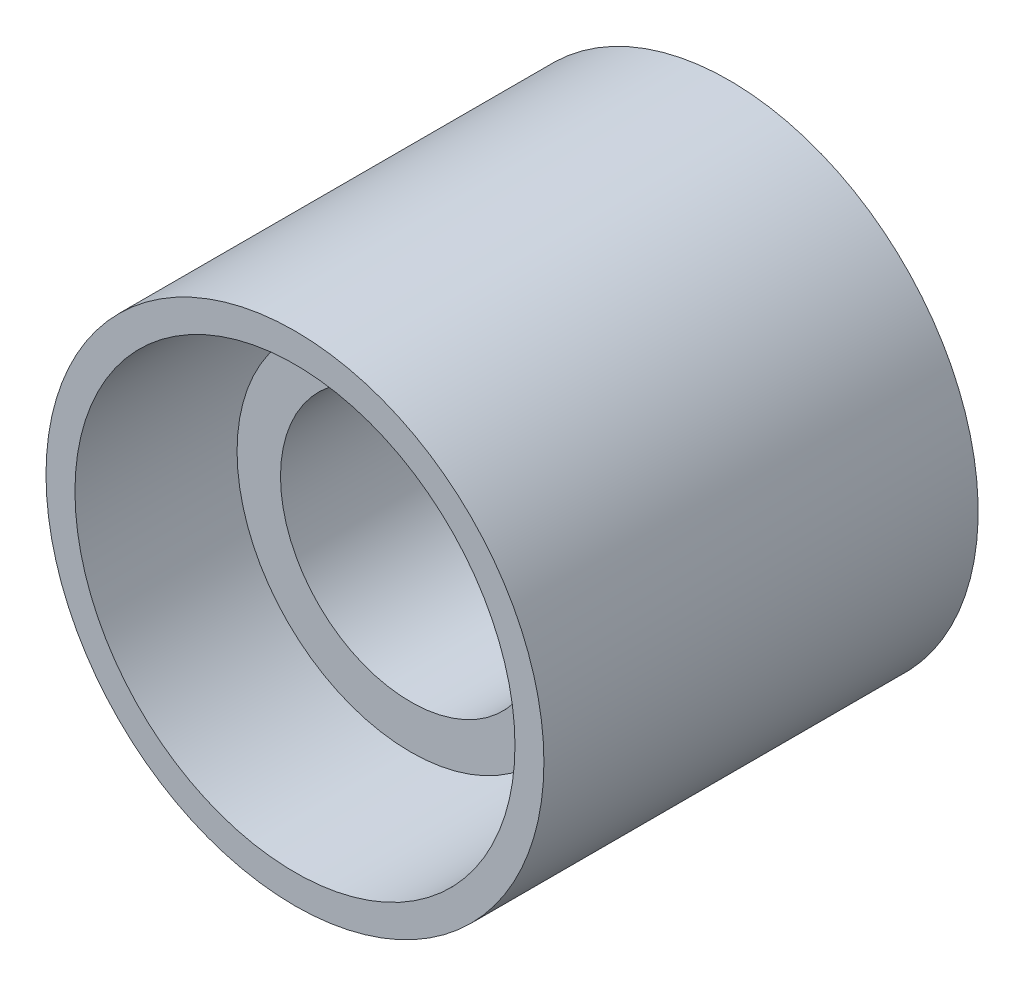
ISO-10303-21;
HEADER;
FILE_DESCRIPTION(('STEP AP214'),'2;1');
FILE_NAME('part.step','',(''),(''),'','','');
FILE_SCHEMA(('AUTOMOTIVE_DESIGN { 1 0 10303 214 1 1 1 1 }'));
ENDSEC;
DATA;
#1=APPLICATION_CONTEXT('core data for automotive mechanical design processes');
#2=APPLICATION_PROTOCOL_DEFINITION('international standard','automotive_design',2000,#1);
#3=PRODUCT_CONTEXT('',#1,'mechanical');
#4=PRODUCT('Part','Part','',(#3));
#5=PRODUCT_RELATED_PRODUCT_CATEGORY('part','',(#4));
#6=PRODUCT_DEFINITION_FORMATION('','',#4);
#7=PRODUCT_DEFINITION_CONTEXT('part definition',#1,'design');
#8=PRODUCT_DEFINITION('design','',#6,#7);
#9=PRODUCT_DEFINITION_SHAPE('','',#8);
#10=(LENGTH_UNIT() NAMED_UNIT(*) SI_UNIT(.MILLI.,.METRE.));
#11=(NAMED_UNIT(*) PLANE_ANGLE_UNIT() SI_UNIT($,.RADIAN.));
#12=(NAMED_UNIT(*) SI_UNIT($,.STERADIAN.) SOLID_ANGLE_UNIT());
#13=UNCERTAINTY_MEASURE_WITH_UNIT(LENGTH_MEASURE(1.E-05),#10,'distance_accuracy_value','');
#14=(GEOMETRIC_REPRESENTATION_CONTEXT(3) GLOBAL_UNCERTAINTY_ASSIGNED_CONTEXT((#13)) GLOBAL_UNIT_ASSIGNED_CONTEXT((#10,
#11,#12)) REPRESENTATION_CONTEXT('',''));
#15=CARTESIAN_POINT('',(0.,0.,0.));
#16=DIRECTION('',(0.,0.,1.));
#17=DIRECTION('',(1.,0.,0.));
#18=AXIS2_PLACEMENT_3D('',#15,#16,#17);
#19=CARTESIAN_POINT('',(0.,0.,40.));
#20=DIRECTION('',(0.,0.,1.));
#21=DIRECTION('',(1.,0.,0.));
#22=AXIS2_PLACEMENT_3D('',#19,#20,#21);
#23=PLANE('',#22);
#24=CARTESIAN_POINT('',(0.,0.,40.));
#25=DIRECTION('',(0.,0.,1.));
#26=DIRECTION('',(1.,0.,0.));
#27=AXIS2_PLACEMENT_3D('',#24,#25,#26);
#28=CIRCLE('',#27,43.);
#29=CARTESIAN_POINT('',(43.,0.,40.));
#30=VERTEX_POINT('',#29);
#31=EDGE_CURVE('E10',#30,#30,#28,.T.);
#32=ORIENTED_EDGE('',*,*,#31,.T.);
#33=EDGE_LOOP('',(#32));
#34=FACE_BOUND('',#33,.T.);
#35=CARTESIAN_POINT('',(0.,0.,40.));
#36=DIRECTION('',(0.,0.,1.));
#37=DIRECTION('',(1.,0.,0.));
#38=AXIS2_PLACEMENT_3D('',#35,#36,#37);
#39=CIRCLE('',#38,38.);
#40=CARTESIAN_POINT('',(38.,0.,40.));
#41=VERTEX_POINT('',#40);
#42=EDGE_CURVE('E45',#41,#41,#39,.T.);
#43=ORIENTED_EDGE('',*,*,#42,.F.);
#44=EDGE_LOOP('',(#43));
#45=FACE_BOUND('',#44,.T.);
#46=ADVANCED_FACE('F37',(#34,#45),#23,.T.);
#47=CARTESIAN_POINT('',(0.,0.,40.));
#48=DIRECTION('',(0.,0.,-1.));
#49=DIRECTION('',(-1.,0.,0.));
#50=AXIS2_PLACEMENT_3D('',#47,#48,#49);
#51=CYLINDRICAL_SURFACE('',#50,43.);
#52=ORIENTED_EDGE('',*,*,#31,.F.);
#53=EDGE_LOOP('',(#52));
#54=FACE_BOUND('',#53,.T.);
#55=CARTESIAN_POINT('',(0.,0.,-35.));
#56=DIRECTION('',(0.,0.,-1.));
#57=DIRECTION('',(-1.,0.,0.));
#58=AXIS2_PLACEMENT_3D('',#55,#56,#57);
#59=CIRCLE('',#58,43.);
#60=CARTESIAN_POINT('',(-43.,0.,-35.));
#61=VERTEX_POINT('',#60);
#62=EDGE_CURVE('E54',#61,#61,#59,.T.);
#63=ORIENTED_EDGE('',*,*,#62,.F.);
#64=EDGE_LOOP('',(#63));
#65=FACE_BOUND('',#64,.T.);
#66=ADVANCED_FACE('F39',(#54,#65),#51,.T.);
#67=CARTESIAN_POINT('',(0.,0.,40.));
#68=DIRECTION('',(0.,0.,-1.));
#69=DIRECTION('',(-1.,0.,0.));
#70=AXIS2_PLACEMENT_3D('',#67,#68,#69);
#71=CYLINDRICAL_SURFACE('',#70,38.);
#72=ORIENTED_EDGE('',*,*,#42,.T.);
#73=EDGE_LOOP('',(#72));
#74=FACE_BOUND('',#73,.T.);
#75=CARTESIAN_POINT('',(0.,0.,0.));
#76=DIRECTION('',(0.,0.,1.));
#77=DIRECTION('',(1.,0.,0.));
#78=AXIS2_PLACEMENT_3D('',#75,#76,#77);
#79=CIRCLE('',#78,38.);
#80=CARTESIAN_POINT('',(38.,0.,0.));
#81=VERTEX_POINT('',#80);
#82=EDGE_CURVE('E49',#81,#81,#79,.T.);
#83=ORIENTED_EDGE('',*,*,#82,.F.);
#84=EDGE_LOOP('',(#83));
#85=FACE_BOUND('',#84,.T.);
#86=ADVANCED_FACE('F86',(#74,#85),#71,.F.);
#87=CARTESIAN_POINT('',(0.,0.,0.));
#88=DIRECTION('',(0.,0.,-1.));
#89=DIRECTION('',(-1.,0.,0.));
#90=AXIS2_PLACEMENT_3D('',#87,#88,#89);
#91=PLANE('',#90);
#92=CARTESIAN_POINT('',(0.,0.,0.));
#93=DIRECTION('',(0.,0.,-1.));
#94=DIRECTION('',(-1.,0.,0.));
#95=AXIS2_PLACEMENT_3D('',#92,#93,#94);
#96=CIRCLE('',#95,30.);
#97=CARTESIAN_POINT('',(-30.,0.,0.));
#98=VERTEX_POINT('',#97);
#99=EDGE_CURVE('E60',#98,#98,#96,.T.);
#100=ORIENTED_EDGE('',*,*,#99,.T.);
#101=EDGE_LOOP('',(#100));
#102=FACE_BOUND('',#101,.T.);
#103=ORIENTED_EDGE('',*,*,#82,.T.);
#104=EDGE_LOOP('',(#103));
#105=FACE_BOUND('',#104,.T.);
#106=ADVANCED_FACE('F91',(#102,#105),#91,.F.);
#107=CARTESIAN_POINT('',(0.,0.,-35.));
#108=DIRECTION('',(0.,0.,-1.));
#109=DIRECTION('',(-1.,0.,0.));
#110=AXIS2_PLACEMENT_3D('',#107,#108,#109);
#111=PLANE('',#110);
#112=CARTESIAN_POINT('',(0.,0.,-35.));
#113=DIRECTION('',(0.,0.,-1.));
#114=DIRECTION('',(-1.,0.,0.));
#115=AXIS2_PLACEMENT_3D('',#112,#113,#114);
#116=CIRCLE('',#115,22.5);
#117=CARTESIAN_POINT('',(-22.5,0.,-35.));
#118=VERTEX_POINT('',#117);
#119=EDGE_CURVE('E63',#118,#118,#116,.T.);
#120=ORIENTED_EDGE('',*,*,#119,.F.);
#121=EDGE_LOOP('',(#120));
#122=FACE_BOUND('',#121,.T.);
#123=ORIENTED_EDGE('',*,*,#62,.T.);
#124=EDGE_LOOP('',(#123));
#125=FACE_BOUND('',#124,.T.);
#126=ADVANCED_FACE('F93',(#122,#125),#111,.T.);
#127=CARTESIAN_POINT('',(0.,0.,20.));
#128=DIRECTION('',(0.,0.,-1.));
#129=DIRECTION('',(-1.,0.,0.));
#130=AXIS2_PLACEMENT_3D('',#127,#128,#129);
#131=CYLINDRICAL_SURFACE('',#130,30.);
#132=CARTESIAN_POINT('',(0.,0.,20.));
#133=DIRECTION('',(0.,0.,-1.));
#134=DIRECTION('',(-1.,0.,0.));
#135=AXIS2_PLACEMENT_3D('',#132,#133,#134);
#136=CIRCLE('',#135,30.);
#137=CARTESIAN_POINT('',(-30.,0.,20.));
#138=VERTEX_POINT('',#137);
#139=EDGE_CURVE('E57',#138,#138,#136,.T.);
#140=ORIENTED_EDGE('',*,*,#139,.T.);
#141=EDGE_LOOP('',(#140));
#142=FACE_BOUND('',#141,.T.);
#143=ORIENTED_EDGE('',*,*,#99,.F.);
#144=EDGE_LOOP('',(#143));
#145=FACE_BOUND('',#144,.T.);
#146=ADVANCED_FACE('F79',(#142,#145),#131,.T.);
#147=CARTESIAN_POINT('',(0.,0.,20.));
#148=DIRECTION('',(0.,0.,-1.));
#149=DIRECTION('',(-1.,0.,0.));
#150=AXIS2_PLACEMENT_3D('',#147,#148,#149);
#151=PLANE('',#150);
#152=CARTESIAN_POINT('',(0.,0.,20.));
#153=DIRECTION('',(0.,0.,-1.));
#154=DIRECTION('',(-1.,0.,0.));
#155=AXIS2_PLACEMENT_3D('',#152,#153,#154);
#156=CIRCLE('',#155,22.5);
#157=CARTESIAN_POINT('',(-22.5,0.,20.));
#158=VERTEX_POINT('',#157);
#159=EDGE_CURVE('E41',#158,#158,#156,.T.);
#160=ORIENTED_EDGE('',*,*,#159,.T.);
#161=EDGE_LOOP('',(#160));
#162=FACE_BOUND('',#161,.T.);
#163=ORIENTED_EDGE('',*,*,#139,.F.);
#164=EDGE_LOOP('',(#163));
#165=FACE_BOUND('',#164,.T.);
#166=ADVANCED_FACE('F70',(#162,#165),#151,.F.);
#167=CARTESIAN_POINT('',(0.,0.,40.));
#168=DIRECTION('',(0.,0.,-1.));
#169=DIRECTION('',(-1.,0.,0.));
#170=AXIS2_PLACEMENT_3D('',#167,#168,#169);
#171=CYLINDRICAL_SURFACE('',#170,22.5);
#172=ORIENTED_EDGE('',*,*,#119,.T.);
#173=EDGE_LOOP('',(#172));
#174=FACE_BOUND('',#173,.T.);
#175=ORIENTED_EDGE('',*,*,#159,.F.);
#176=EDGE_LOOP('',(#175));
#177=FACE_BOUND('',#176,.T.);
#178=ADVANCED_FACE('F73',(#174,#177),#171,.F.);
#179=CLOSED_SHELL('',(#46,#66,#86,#106,#126,#146,#166,#178));
#180=MANIFOLD_SOLID_BREP('B2',#179);
#181=ADVANCED_BREP_SHAPE_REPRESENTATION('',(#18,#180),#14);
#182=SHAPE_DEFINITION_REPRESENTATION(#9,#181);
ENDSEC;
END-ISO-10303-21;
